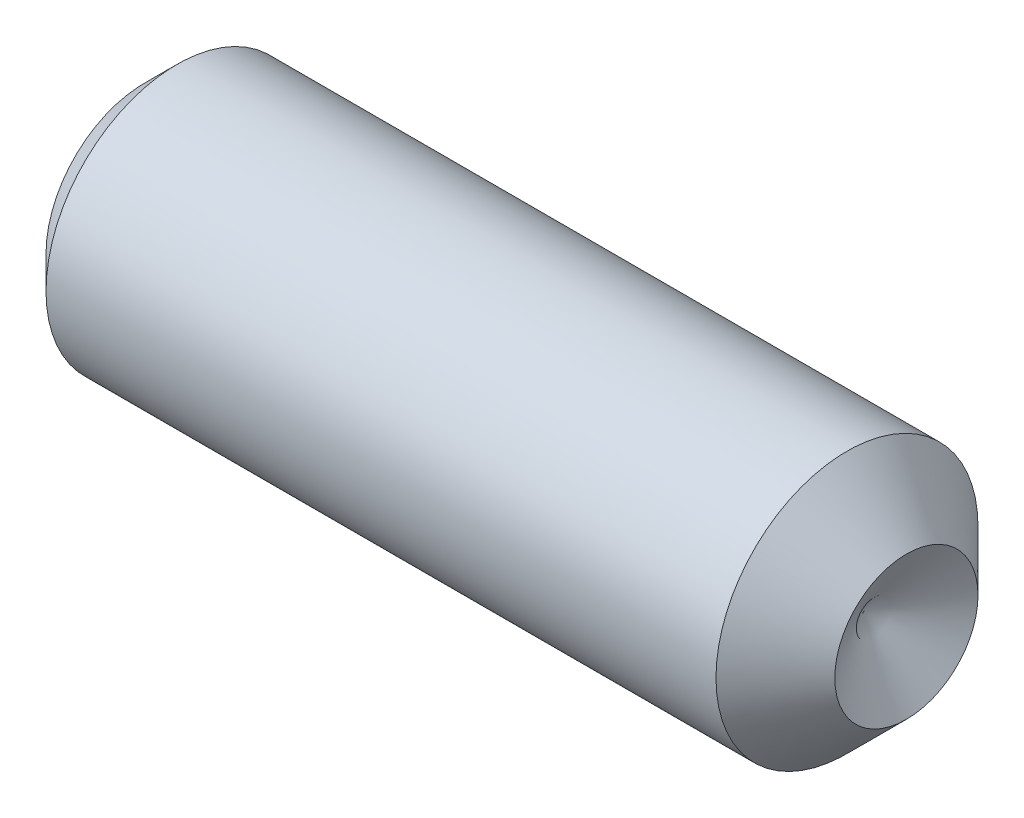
ISO-10303-21;
HEADER;
FILE_DESCRIPTION(('STEP AP214'),'2;1');
FILE_NAME('part.step','',(''),(''),'','','');
FILE_SCHEMA(('AUTOMOTIVE_DESIGN { 1 0 10303 214 1 1 1 1 }'));
ENDSEC;
DATA;
#1=APPLICATION_CONTEXT('core data for automotive mechanical design processes');
#2=APPLICATION_PROTOCOL_DEFINITION('international standard','automotive_design',2000,#1);
#3=PRODUCT_CONTEXT('',#1,'mechanical');
#4=PRODUCT('Part','Part','',(#3));
#5=PRODUCT_RELATED_PRODUCT_CATEGORY('part','',(#4));
#6=PRODUCT_DEFINITION_FORMATION('','',#4);
#7=PRODUCT_DEFINITION_CONTEXT('part definition',#1,'design');
#8=PRODUCT_DEFINITION('design','',#6,#7);
#9=PRODUCT_DEFINITION_SHAPE('','',#8);
#10=(LENGTH_UNIT() NAMED_UNIT(*) SI_UNIT(.MILLI.,.METRE.));
#11=(NAMED_UNIT(*) PLANE_ANGLE_UNIT() SI_UNIT($,.RADIAN.));
#12=(NAMED_UNIT(*) SI_UNIT($,.STERADIAN.) SOLID_ANGLE_UNIT());
#13=UNCERTAINTY_MEASURE_WITH_UNIT(LENGTH_MEASURE(1.E-05),#10,'distance_accuracy_value','');
#14=(GEOMETRIC_REPRESENTATION_CONTEXT(3) GLOBAL_UNCERTAINTY_ASSIGNED_CONTEXT((#13)) GLOBAL_UNIT_ASSIGNED_CONTEXT((#10,
#11,#12)) REPRESENTATION_CONTEXT('',''));
#15=CARTESIAN_POINT('',(0.,0.,0.));
#16=DIRECTION('',(0.,0.,1.));
#17=DIRECTION('',(1.,0.,0.));
#18=AXIS2_PLACEMENT_3D('',#15,#16,#17);
#19=CARTESIAN_POINT('',(0.,0.,0.));
#20=DIRECTION('',(-1.,0.,0.));
#21=DIRECTION('',(0.,0.,1.));
#22=AXIS2_PLACEMENT_3D('',#19,#20,#21);
#23=PLANE('',#22);
#24=CARTESIAN_POINT('',(0.,0.,0.));
#25=DIRECTION('',(-1.,0.,0.));
#26=DIRECTION('',(0.,0.,1.));
#27=AXIS2_PLACEMENT_3D('',#24,#25,#26);
#28=CIRCLE('',#27,0.822960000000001);
#29=CARTESIAN_POINT('',(0.,0.,0.822960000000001));
#30=VERTEX_POINT('',#29);
#31=EDGE_CURVE('E11',#30,#30,#28,.T.);
#32=ORIENTED_EDGE('',*,*,#31,.T.);
#33=EDGE_LOOP('',(#32));
#34=FACE_BOUND('',#33,.T.);
#35=DIRECTION('',(0.,0.,-1.));
#36=VECTOR('',#35,1.);
#37=CARTESIAN_POINT('',(0.,0.444500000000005,0.256632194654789));
#38=LINE('',#37,#36);
#39=CARTESIAN_POINT('',(0.,0.444500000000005,0.256632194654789));
#40=VERTEX_POINT('',#39);
#41=CARTESIAN_POINT('',(0.,0.444500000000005,-0.256632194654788));
#42=VERTEX_POINT('',#41);
#43=EDGE_CURVE('E102',#40,#42,#38,.T.);
#44=ORIENTED_EDGE('',*,*,#43,.F.);
#45=DIRECTION('',(0.,-0.866025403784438,0.5));
#46=VECTOR('',#45,1.);
#47=CARTESIAN_POINT('',(0.,0.444500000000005,0.256632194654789));
#48=LINE('',#47,#46);
#49=CARTESIAN_POINT('',(0.,0.,0.513264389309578));
#50=VERTEX_POINT('',#49);
#51=EDGE_CURVE('E44',#40,#50,#48,.T.);
#52=ORIENTED_EDGE('',*,*,#51,.T.);
#53=DIRECTION('',(0.,0.866025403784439,0.5));
#54=VECTOR('',#53,1.);
#55=CARTESIAN_POINT('',(0.,-0.444499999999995,0.256632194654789));
#56=LINE('',#55,#54);
#57=CARTESIAN_POINT('',(0.,-0.444499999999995,0.256632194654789));
#58=VERTEX_POINT('',#57);
#59=EDGE_CURVE('E92',#58,#50,#56,.T.);
#60=ORIENTED_EDGE('',*,*,#59,.F.);
#61=DIRECTION('',(0.,0.,-1.));
#62=VECTOR('',#61,1.);
#63=CARTESIAN_POINT('',(0.,-0.444499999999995,0.256632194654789));
#64=LINE('',#63,#62);
#65=CARTESIAN_POINT('',(0.,-0.444499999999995,-0.256632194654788));
#66=VERTEX_POINT('',#65);
#67=EDGE_CURVE('E97',#58,#66,#64,.T.);
#68=ORIENTED_EDGE('',*,*,#67,.T.);
#69=DIRECTION('',(0.,0.866025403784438,-0.500000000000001));
#70=VECTOR('',#69,1.);
#71=CARTESIAN_POINT('',(0.,-0.444499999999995,-0.256632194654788));
#72=LINE('',#71,#70);
#73=CARTESIAN_POINT('',(0.,0.,-0.513264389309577));
#74=VERTEX_POINT('',#73);
#75=EDGE_CURVE('E106',#66,#74,#72,.T.);
#76=ORIENTED_EDGE('',*,*,#75,.T.);
#77=DIRECTION('',(0.,-0.866025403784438,-0.5));
#78=VECTOR('',#77,1.);
#79=CARTESIAN_POINT('',(0.,0.444500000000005,-0.256632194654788));
#80=LINE('',#79,#78);
#81=EDGE_CURVE('E109',#42,#74,#80,.T.);
#82=ORIENTED_EDGE('',*,*,#81,.F.);
#83=EDGE_LOOP('',(#44,#52,#60,#68,#76,#82));
#84=FACE_BOUND('',#83,.T.);
#85=ADVANCED_FACE('F30',(#34,#84),#23,.T.);
#86=CARTESIAN_POINT('',(0.,0.,0.));
#87=DIRECTION('',(1.,0.,0.));
#88=DIRECTION('',(0.,0.,-1.));
#89=AXIS2_PLACEMENT_3D('',#86,#87,#88);
#90=CONICAL_SURFACE('',#89,0.822960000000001,0.78539816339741);
#91=CARTESIAN_POINT('',(0.26924000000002,0.,0.));
#92=DIRECTION('',(-1.,0.,0.));
#93=DIRECTION('',(0.,0.,1.));
#94=AXIS2_PLACEMENT_3D('',#91,#92,#93);
#95=CIRCLE('',#94,1.0922);
#96=CARTESIAN_POINT('',(0.26924000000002,0.,1.0922));
#97=VERTEX_POINT('',#96);
#98=EDGE_CURVE('E37',#97,#97,#95,.T.);
#99=ORIENTED_EDGE('',*,*,#98,.T.);
#100=EDGE_LOOP('',(#99));
#101=FACE_BOUND('',#100,.T.);
#102=ORIENTED_EDGE('',*,*,#31,.F.);
#103=EDGE_LOOP('',(#102));
#104=FACE_BOUND('',#103,.T.);
#105=ADVANCED_FACE('F142',(#101,#104),#90,.T.);
#106=CARTESIAN_POINT('',(-12.7,0.,0.));
#107=DIRECTION('',(-1.,0.,0.));
#108=DIRECTION('',(0.,0.,1.));
#109=AXIS2_PLACEMENT_3D('',#106,#107,#108);
#110=CYLINDRICAL_SURFACE('',#109,1.0922);
#111=CARTESIAN_POINT('',(5.85470000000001,0.,0.));
#112=DIRECTION('',(-1.,0.,0.));
#113=DIRECTION('',(0.,0.,1.));
#114=AXIS2_PLACEMENT_3D('',#111,#112,#113);
#115=CIRCLE('',#114,1.0922);
#116=CARTESIAN_POINT('',(5.85470000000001,0.,1.0922));
#117=VERTEX_POINT('',#116);
#118=EDGE_CURVE('E137',#117,#117,#115,.T.);
#119=ORIENTED_EDGE('',*,*,#118,.T.);
#120=EDGE_LOOP('',(#119));
#121=FACE_BOUND('',#120,.T.);
#122=ORIENTED_EDGE('',*,*,#98,.F.);
#123=EDGE_LOOP('',(#122));
#124=FACE_BOUND('',#123,.T.);
#125=ADVANCED_FACE('F145',(#121,#124),#110,.T.);
#126=CARTESIAN_POINT('',(5.85470000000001,0.,0.));
#127=DIRECTION('',(-1.,0.,0.));
#128=DIRECTION('',(0.,0.,1.));
#129=AXIS2_PLACEMENT_3D('',#126,#127,#128);
#130=CONICAL_SURFACE('',#129,1.0922,0.785398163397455);
#131=CARTESIAN_POINT('',(6.35,0.,0.));
#132=DIRECTION('',(-1.,0.,0.));
#133=DIRECTION('',(0.,0.,1.));
#134=AXIS2_PLACEMENT_3D('',#131,#132,#133);
#135=CIRCLE('',#134,0.5969);
#136=CARTESIAN_POINT('',(6.35,0.,0.5969));
#137=VERTEX_POINT('',#136);
#138=EDGE_CURVE('E88',#137,#137,#135,.T.);
#139=ORIENTED_EDGE('',*,*,#138,.T.);
#140=EDGE_LOOP('',(#139));
#141=FACE_BOUND('',#140,.T.);
#142=ORIENTED_EDGE('',*,*,#118,.F.);
#143=EDGE_LOOP('',(#142));
#144=FACE_BOUND('',#143,.T.);
#145=ADVANCED_FACE('F147',(#141,#144),#130,.T.);
#146=CARTESIAN_POINT('',(5.99134629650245,0.,0.));
#147=DIRECTION('',(1.,0.,0.));
#148=DIRECTION('',(0.,0.,-1.));
#149=AXIS2_PLACEMENT_3D('',#146,#147,#148);
#150=CONICAL_SURFACE('',#149,0.,1.02974425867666);
#151=ORIENTED_EDGE('',*,*,#138,.F.);
#152=EDGE_LOOP('',(#151));
#153=FACE_BOUND('',#152,.T.);
#154=CARTESIAN_POINT('',(5.99134629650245,0.,0.));
#155=VERTEX_POINT('',#154);
#156=VERTEX_LOOP('',#155);
#157=FACE_BOUND('',#156,.T.);
#158=ADVANCED_FACE('F154',(#153,#157),#150,.F.);
#159=CARTESIAN_POINT('',(1.524,0.444500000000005,0.256632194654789));
#160=DIRECTION('',(0.,-0.5,-0.866025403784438));
#161=DIRECTION('',(0.,0.866025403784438,-0.500000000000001));
#162=AXIS2_PLACEMENT_3D('',#159,#160,#161);
#163=PLANE('',#162);
#164=ORIENTED_EDGE('',*,*,#51,.F.);
#165=DIRECTION('',(-1.,0.,0.));
#166=VECTOR('',#165,1.);
#167=CARTESIAN_POINT('',(1.524,0.444500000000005,0.256632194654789));
#168=LINE('',#167,#166);
#169=CARTESIAN_POINT('',(1.524,0.444500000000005,0.256632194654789));
#170=VERTEX_POINT('',#169);
#171=EDGE_CURVE('E126',#170,#40,#168,.T.);
#172=ORIENTED_EDGE('',*,*,#171,.F.);
#173=DIRECTION('',(0.,-0.866025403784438,0.5));
#174=VECTOR('',#173,1.);
#175=CARTESIAN_POINT('',(1.524,0.444500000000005,0.256632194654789));
#176=LINE('',#175,#174);
#177=CARTESIAN_POINT('',(1.524,0.,0.513264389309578));
#178=VERTEX_POINT('',#177);
#179=EDGE_CURVE('E84',#170,#178,#176,.T.);
#180=ORIENTED_EDGE('',*,*,#179,.T.);
#181=DIRECTION('',(-1.,0.,0.));
#182=VECTOR('',#181,1.);
#183=CARTESIAN_POINT('',(1.524,0.,0.513264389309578));
#184=LINE('',#183,#182);
#185=EDGE_CURVE('E80',#178,#50,#184,.T.);
#186=ORIENTED_EDGE('',*,*,#185,.T.);
#187=EDGE_LOOP('',(#164,#172,#180,#186));
#188=FACE_BOUND('',#187,.T.);
#189=ADVANCED_FACE('F82',(#188),#163,.T.);
#190=CARTESIAN_POINT('',(1.524,-0.444499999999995,0.256632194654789));
#191=DIRECTION('',(0.,-0.5,0.866025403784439));
#192=DIRECTION('',(0.,-0.866025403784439,-0.5));
#193=AXIS2_PLACEMENT_3D('',#190,#191,#192);
#194=PLANE('',#193);
#195=ORIENTED_EDGE('',*,*,#59,.T.);
#196=ORIENTED_EDGE('',*,*,#185,.F.);
#197=DIRECTION('',(0.,0.866025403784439,0.5));
#198=VECTOR('',#197,1.);
#199=CARTESIAN_POINT('',(1.524,-0.444499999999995,0.256632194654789));
#200=LINE('',#199,#198);
#201=CARTESIAN_POINT('',(1.524,-0.444499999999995,0.256632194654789));
#202=VERTEX_POINT('',#201);
#203=EDGE_CURVE('E114',#202,#178,#200,.T.);
#204=ORIENTED_EDGE('',*,*,#203,.F.);
#205=DIRECTION('',(-1.,0.,0.));
#206=VECTOR('',#205,1.);
#207=CARTESIAN_POINT('',(1.524,-0.444499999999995,0.256632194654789));
#208=LINE('',#207,#206);
#209=EDGE_CURVE('E89',#202,#58,#208,.T.);
#210=ORIENTED_EDGE('',*,*,#209,.T.);
#211=EDGE_LOOP('',(#195,#196,#204,#210));
#212=FACE_BOUND('',#211,.T.);
#213=ADVANCED_FACE('F93',(#212),#194,.F.);
#214=CARTESIAN_POINT('',(1.524,-0.444499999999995,0.256632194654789));
#215=DIRECTION('',(0.,1.,0.));
#216=DIRECTION('',(0.,0.,1.));
#217=AXIS2_PLACEMENT_3D('',#214,#215,#216);
#218=PLANE('',#217);
#219=ORIENTED_EDGE('',*,*,#67,.F.);
#220=ORIENTED_EDGE('',*,*,#209,.F.);
#221=DIRECTION('',(0.,0.,-1.));
#222=VECTOR('',#221,1.);
#223=CARTESIAN_POINT('',(1.524,-0.444499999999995,0.256632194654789));
#224=LINE('',#223,#222);
#225=CARTESIAN_POINT('',(1.524,-0.444499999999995,-0.256632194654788));
#226=VERTEX_POINT('',#225);
#227=EDGE_CURVE('E116',#202,#226,#224,.T.);
#228=ORIENTED_EDGE('',*,*,#227,.T.);
#229=DIRECTION('',(-1.,0.,0.));
#230=VECTOR('',#229,1.);
#231=CARTESIAN_POINT('',(1.524,-0.444499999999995,-0.256632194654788));
#232=LINE('',#231,#230);
#233=EDGE_CURVE('E132',#226,#66,#232,.T.);
#234=ORIENTED_EDGE('',*,*,#233,.T.);
#235=EDGE_LOOP('',(#219,#220,#228,#234));
#236=FACE_BOUND('',#235,.T.);
#237=ADVANCED_FACE('F199',(#236),#218,.T.);
#238=CARTESIAN_POINT('',(1.524,-0.444499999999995,-0.256632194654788));
#239=DIRECTION('',(0.,0.500000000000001,0.866025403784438));
#240=DIRECTION('',(0.,-0.866025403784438,0.500000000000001));
#241=AXIS2_PLACEMENT_3D('',#238,#239,#240);
#242=PLANE('',#241);
#243=ORIENTED_EDGE('',*,*,#75,.F.);
#244=ORIENTED_EDGE('',*,*,#233,.F.);
#245=DIRECTION('',(0.,0.866025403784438,-0.500000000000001));
#246=VECTOR('',#245,1.);
#247=CARTESIAN_POINT('',(1.524,-0.444499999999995,-0.256632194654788));
#248=LINE('',#247,#246);
#249=CARTESIAN_POINT('',(1.524,0.,-0.513264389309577));
#250=VERTEX_POINT('',#249);
#251=EDGE_CURVE('E118',#226,#250,#248,.T.);
#252=ORIENTED_EDGE('',*,*,#251,.T.);
#253=DIRECTION('',(-1.,0.,0.));
#254=VECTOR('',#253,1.);
#255=CARTESIAN_POINT('',(1.524,0.,-0.513264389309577));
#256=LINE('',#255,#254);
#257=EDGE_CURVE('E130',#250,#74,#256,.T.);
#258=ORIENTED_EDGE('',*,*,#257,.T.);
#259=EDGE_LOOP('',(#243,#244,#252,#258));
#260=FACE_BOUND('',#259,.T.);
#261=ADVANCED_FACE('F206',(#260),#242,.T.);
#262=CARTESIAN_POINT('',(1.524,0.444500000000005,-0.256632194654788));
#263=DIRECTION('',(0.,0.5,-0.866025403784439));
#264=DIRECTION('',(0.,0.866025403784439,0.5));
#265=AXIS2_PLACEMENT_3D('',#262,#263,#264);
#266=PLANE('',#265);
#267=ORIENTED_EDGE('',*,*,#81,.T.);
#268=ORIENTED_EDGE('',*,*,#257,.F.);
#269=DIRECTION('',(0.,-0.866025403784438,-0.5));
#270=VECTOR('',#269,1.);
#271=CARTESIAN_POINT('',(1.524,0.444500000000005,-0.256632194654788));
#272=LINE('',#271,#270);
#273=CARTESIAN_POINT('',(1.524,0.444500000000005,-0.256632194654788));
#274=VERTEX_POINT('',#273);
#275=EDGE_CURVE('E120',#274,#250,#272,.T.);
#276=ORIENTED_EDGE('',*,*,#275,.F.);
#277=DIRECTION('',(-1.,0.,0.));
#278=VECTOR('',#277,1.);
#279=CARTESIAN_POINT('',(1.524,0.444500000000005,-0.256632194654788));
#280=LINE('',#279,#278);
#281=EDGE_CURVE('E128',#274,#42,#280,.T.);
#282=ORIENTED_EDGE('',*,*,#281,.T.);
#283=EDGE_LOOP('',(#267,#268,#276,#282));
#284=FACE_BOUND('',#283,.T.);
#285=ADVANCED_FACE('F214',(#284),#266,.F.);
#286=CARTESIAN_POINT('',(1.524,0.444500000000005,0.256632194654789));
#287=DIRECTION('',(0.,1.,0.));
#288=DIRECTION('',(0.,0.,1.));
#289=AXIS2_PLACEMENT_3D('',#286,#287,#288);
#290=PLANE('',#289);
#291=ORIENTED_EDGE('',*,*,#43,.T.);
#292=ORIENTED_EDGE('',*,*,#281,.F.);
#293=DIRECTION('',(0.,0.,-1.));
#294=VECTOR('',#293,1.);
#295=CARTESIAN_POINT('',(1.524,0.444500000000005,0.256632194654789));
#296=LINE('',#295,#294);
#297=EDGE_CURVE('E123',#170,#274,#296,.T.);
#298=ORIENTED_EDGE('',*,*,#297,.F.);
#299=ORIENTED_EDGE('',*,*,#171,.T.);
#300=EDGE_LOOP('',(#291,#292,#298,#299));
#301=FACE_BOUND('',#300,.T.);
#302=ADVANCED_FACE('F222',(#301),#290,.F.);
#303=CARTESIAN_POINT('',(1.524,0.889000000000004,0.));
#304=DIRECTION('',(1.,0.,0.));
#305=DIRECTION('',(0.,0.,-1.));
#306=AXIS2_PLACEMENT_3D('',#303,#304,#305);
#307=PLANE('',#306);
#308=ORIENTED_EDGE('',*,*,#179,.F.);
#309=ORIENTED_EDGE('',*,*,#297,.T.);
#310=ORIENTED_EDGE('',*,*,#275,.T.);
#311=ORIENTED_EDGE('',*,*,#251,.F.);
#312=ORIENTED_EDGE('',*,*,#227,.F.);
#313=ORIENTED_EDGE('',*,*,#203,.T.);
#314=EDGE_LOOP('',(#308,#309,#310,#311,#312,#313));
#315=FACE_BOUND('',#314,.T.);
#316=ADVANCED_FACE('F230',(#315),#307,.F.);
#317=CLOSED_SHELL('',(#85,#105,#125,#145,#158,#189,#213,#237,#261,#285,#302,#316));
#318=MANIFOLD_SOLID_BREP('B2',#317);
#319=ADVANCED_BREP_SHAPE_REPRESENTATION('',(#18,#318),#14);
#320=SHAPE_DEFINITION_REPRESENTATION(#9,#319);
ENDSEC;
END-ISO-10303-21;
